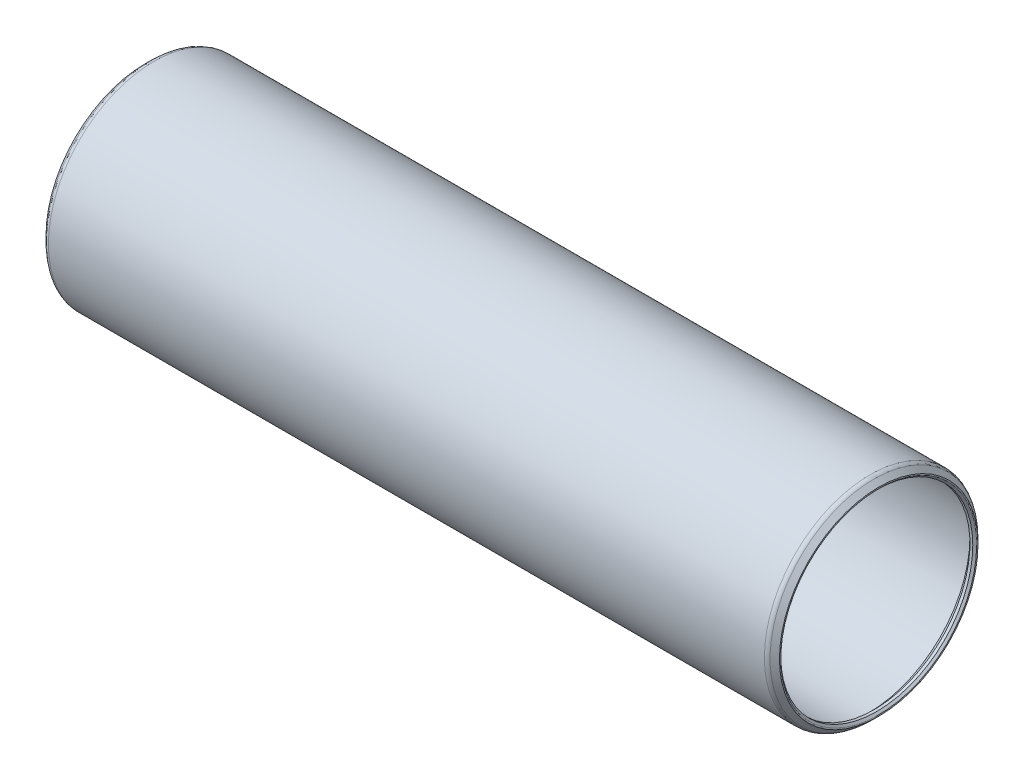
ISO-10303-21;
HEADER;
FILE_DESCRIPTION(('STEP AP214'),'2;1');
FILE_NAME('part.step','',(''),(''),'','','');
FILE_SCHEMA(('AUTOMOTIVE_DESIGN { 1 0 10303 214 1 1 1 1 }'));
ENDSEC;
DATA;
#1=APPLICATION_CONTEXT('core data for automotive mechanical design processes');
#2=APPLICATION_PROTOCOL_DEFINITION('international standard','automotive_design',2000,#1);
#3=PRODUCT_CONTEXT('',#1,'mechanical');
#4=PRODUCT('Part','Part','',(#3));
#5=PRODUCT_RELATED_PRODUCT_CATEGORY('part','',(#4));
#6=PRODUCT_DEFINITION_FORMATION('','',#4);
#7=PRODUCT_DEFINITION_CONTEXT('part definition',#1,'design');
#8=PRODUCT_DEFINITION('design','',#6,#7);
#9=PRODUCT_DEFINITION_SHAPE('','',#8);
#10=(LENGTH_UNIT() NAMED_UNIT(*) SI_UNIT(.MILLI.,.METRE.));
#11=(NAMED_UNIT(*) PLANE_ANGLE_UNIT() SI_UNIT($,.RADIAN.));
#12=(NAMED_UNIT(*) SI_UNIT($,.STERADIAN.) SOLID_ANGLE_UNIT());
#13=UNCERTAINTY_MEASURE_WITH_UNIT(LENGTH_MEASURE(1.E-05),#10,'distance_accuracy_value','');
#14=(GEOMETRIC_REPRESENTATION_CONTEXT(3) GLOBAL_UNCERTAINTY_ASSIGNED_CONTEXT((#13)) GLOBAL_UNIT_ASSIGNED_CONTEXT((#10,
#11,#12)) REPRESENTATION_CONTEXT('',''));
#15=CARTESIAN_POINT('',(0.,0.,0.));
#16=DIRECTION('',(0.,0.,1.));
#17=DIRECTION('',(1.,0.,0.));
#18=AXIS2_PLACEMENT_3D('',#15,#16,#17);
#19=CARTESIAN_POINT('',(96.8629,0.,0.));
#20=DIRECTION('',(-1.,0.,0.));
#21=DIRECTION('',(0.,0.,1.));
#22=AXIS2_PLACEMENT_3D('',#19,#20,#21);
#23=CYLINDRICAL_SURFACE('',#22,13.60805);
#24=CARTESIAN_POINT('',(0.761999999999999,0.,0.));
#25=DIRECTION('',(1.,0.,0.));
#26=DIRECTION('',(0.,0.,-1.));
#27=AXIS2_PLACEMENT_3D('',#24,#25,#26);
#28=CIRCLE('',#27,13.60805);
#29=CARTESIAN_POINT('',(0.761999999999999,0.,-13.60805));
#30=VERTEX_POINT('',#29);
#31=EDGE_CURVE('E117',#30,#30,#28,.F.);
#32=ORIENTED_EDGE('',*,*,#31,.T.);
#33=EDGE_LOOP('',(#32));
#34=FACE_BOUND('',#33,.T.);
#35=CARTESIAN_POINT('',(96.1009,0.,0.));
#36=DIRECTION('',(-1.,0.,0.));
#37=DIRECTION('',(0.,0.,1.));
#38=AXIS2_PLACEMENT_3D('',#35,#36,#37);
#39=CIRCLE('',#38,13.60805);
#40=CARTESIAN_POINT('',(96.1009,0.,13.60805));
#41=VERTEX_POINT('',#40);
#42=EDGE_CURVE('E112',#41,#41,#39,.F.);
#43=ORIENTED_EDGE('',*,*,#42,.T.);
#44=EDGE_LOOP('',(#43));
#45=FACE_BOUND('',#44,.T.);
#46=ADVANCED_FACE('F15',(#34,#45),#23,.F.);
#47=CARTESIAN_POINT('',(0.761999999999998,0.,0.));
#48=DIRECTION('',(1.,0.,0.));
#49=DIRECTION('',(0.,1.,0.));
#50=AXIS2_PLACEMENT_3D('',#47,#48,#49);
#51=CONICAL_SURFACE('',#50,13.60805,0.78539816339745);
#52=CARTESIAN_POINT('',(0.,0.,0.));
#53=DIRECTION('',(-1.,0.,0.));
#54=DIRECTION('',(0.,0.,1.));
#55=AXIS2_PLACEMENT_3D('',#52,#53,#54);
#56=CIRCLE('',#55,12.84605);
#57=CARTESIAN_POINT('',(0.,0.,12.84605));
#58=VERTEX_POINT('',#57);
#59=EDGE_CURVE('E107',#58,#58,#56,.T.);
#60=ORIENTED_EDGE('',*,*,#59,.T.);
#61=EDGE_LOOP('',(#60));
#62=FACE_BOUND('',#61,.T.);
#63=ORIENTED_EDGE('',*,*,#31,.F.);
#64=EDGE_LOOP('',(#63));
#65=FACE_BOUND('',#64,.T.);
#66=ADVANCED_FACE('F124',(#62,#65),#51,.F.);
#67=CARTESIAN_POINT('',(96.1009,0.,0.));
#68=DIRECTION('',(-1.,0.,0.));
#69=DIRECTION('',(0.,-1.,0.));
#70=AXIS2_PLACEMENT_3D('',#67,#68,#69);
#71=CONICAL_SURFACE('',#70,13.60805,0.785398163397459);
#72=ORIENTED_EDGE('',*,*,#42,.F.);
#73=EDGE_LOOP('',(#72));
#74=FACE_BOUND('',#73,.T.);
#75=CARTESIAN_POINT('',(96.8629,0.,0.));
#76=DIRECTION('',(-1.,0.,0.));
#77=DIRECTION('',(0.,0.,1.));
#78=AXIS2_PLACEMENT_3D('',#75,#76,#77);
#79=CIRCLE('',#78,12.84605);
#80=CARTESIAN_POINT('',(96.8629,0.,12.84605));
#81=VERTEX_POINT('',#80);
#82=EDGE_CURVE('E102',#81,#81,#79,.F.);
#83=ORIENTED_EDGE('',*,*,#82,.T.);
#84=EDGE_LOOP('',(#83));
#85=FACE_BOUND('',#84,.T.);
#86=ADVANCED_FACE('F126',(#74,#85),#71,.F.);
#87=CARTESIAN_POINT('',(96.8629,0.,0.));
#88=DIRECTION('',(-1.,0.,0.));
#89=DIRECTION('',(0.,0.,1.));
#90=AXIS2_PLACEMENT_3D('',#87,#88,#89);
#91=CYLINDRICAL_SURFACE('',#90,12.84605);
#92=CARTESIAN_POINT('',(-0.381000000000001,0.,0.));
#93=DIRECTION('',(-1.,0.,0.));
#94=DIRECTION('',(0.,0.,1.));
#95=AXIS2_PLACEMENT_3D('',#92,#93,#94);
#96=CIRCLE('',#95,12.84605);
#97=CARTESIAN_POINT('',(-0.381000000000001,0.,12.84605));
#98=VERTEX_POINT('',#97);
#99=EDGE_CURVE('E97',#98,#98,#96,.T.);
#100=ORIENTED_EDGE('',*,*,#99,.T.);
#101=EDGE_LOOP('',(#100));
#102=FACE_BOUND('',#101,.T.);
#103=ORIENTED_EDGE('',*,*,#59,.F.);
#104=EDGE_LOOP('',(#103));
#105=FACE_BOUND('',#104,.T.);
#106=ADVANCED_FACE('F133',(#102,#105),#91,.F.);
#107=CARTESIAN_POINT('',(96.8629,0.,0.));
#108=DIRECTION('',(-1.,0.,0.));
#109=DIRECTION('',(0.,0.,1.));
#110=AXIS2_PLACEMENT_3D('',#107,#108,#109);
#111=CYLINDRICAL_SURFACE('',#110,12.84605);
#112=ORIENTED_EDGE('',*,*,#82,.F.);
#113=EDGE_LOOP('',(#112));
#114=FACE_BOUND('',#113,.T.);
#115=CARTESIAN_POINT('',(97.2439,0.,0.));
#116=DIRECTION('',(1.,0.,0.));
#117=DIRECTION('',(0.,0.,-1.));
#118=AXIS2_PLACEMENT_3D('',#115,#116,#117);
#119=CIRCLE('',#118,12.84605);
#120=CARTESIAN_POINT('',(97.2439,0.,-12.84605));
#121=VERTEX_POINT('',#120);
#122=EDGE_CURVE('E92',#121,#121,#119,.T.);
#123=ORIENTED_EDGE('',*,*,#122,.T.);
#124=EDGE_LOOP('',(#123));
#125=FACE_BOUND('',#124,.T.);
#126=ADVANCED_FACE('F153',(#114,#125),#111,.F.);
#127=CARTESIAN_POINT('',(-0.639512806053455,0.,0.));
#128=DIRECTION('',(-1.,0.,0.));
#129=DIRECTION('',(0.,0.,1.));
#130=AXIS2_PLACEMENT_3D('',#127,#128,#129);
#131=CONICAL_SURFACE('',#130,13.1045628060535,0.785398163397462);
#132=CARTESIAN_POINT('',(-0.639512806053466,0.,0.));
#133=DIRECTION('',(1.,0.,0.));
#134=DIRECTION('',(0.,0.,-1.));
#135=AXIS2_PLACEMENT_3D('',#132,#133,#134);
#136=CIRCLE('',#135,13.1045628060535);
#137=CARTESIAN_POINT('',(-0.639512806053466,0.,-13.1045628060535));
#138=VERTEX_POINT('',#137);
#139=EDGE_CURVE('E89',#138,#138,#136,.T.);
#140=ORIENTED_EDGE('',*,*,#139,.F.);
#141=EDGE_LOOP('',(#140));
#142=FACE_BOUND('',#141,.T.);
#143=ORIENTED_EDGE('',*,*,#99,.F.);
#144=EDGE_LOOP('',(#143));
#145=FACE_BOUND('',#144,.T.);
#146=ADVANCED_FACE('F150',(#142,#145),#131,.F.);
#147=CARTESIAN_POINT('',(97.5024128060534,0.,0.));
#148=DIRECTION('',(1.,0.,0.));
#149=DIRECTION('',(0.,0.,-1.));
#150=AXIS2_PLACEMENT_3D('',#147,#148,#149);
#151=CONICAL_SURFACE('',#150,13.1045628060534,0.785398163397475);
#152=ORIENTED_EDGE('',*,*,#122,.F.);
#153=EDGE_LOOP('',(#152));
#154=FACE_BOUND('',#153,.T.);
#155=CARTESIAN_POINT('',(97.5024128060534,0.,0.));
#156=DIRECTION('',(1.,0.,0.));
#157=DIRECTION('',(0.,0.,-1.));
#158=AXIS2_PLACEMENT_3D('',#155,#156,#157);
#159=CIRCLE('',#158,13.1045628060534);
#160=CARTESIAN_POINT('',(97.5024128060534,0.,-13.1045628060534));
#161=VERTEX_POINT('',#160);
#162=EDGE_CURVE('E67',#161,#161,#159,.F.);
#163=ORIENTED_EDGE('',*,*,#162,.F.);
#164=EDGE_LOOP('',(#163));
#165=FACE_BOUND('',#164,.T.);
#166=ADVANCED_FACE('F83',(#154,#165),#151,.F.);
#167=CARTESIAN_POINT('',(-0.549710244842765,0.,0.));
#168=DIRECTION('',(1.,0.,0.));
#169=DIRECTION('',(0.,0.,-1.));
#170=AXIS2_PLACEMENT_3D('',#167,#168,#169);
#171=TOROIDAL_SURFACE('',#170,13.1943653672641,0.127000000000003);
#172=CARTESIAN_POINT('',(-0.639512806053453,0.,0.));
#173=DIRECTION('',(1.,0.,0.));
#174=DIRECTION('',(0.,0.,-1.));
#175=AXIS2_PLACEMENT_3D('',#172,#173,#174);
#176=CIRCLE('',#175,13.2841679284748);
#177=CARTESIAN_POINT('',(-0.639512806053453,0.,-13.2841679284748));
#178=VERTEX_POINT('',#177);
#179=EDGE_CURVE('E62',#178,#178,#176,.T.);
#180=ORIENTED_EDGE('',*,*,#179,.F.);
#181=EDGE_LOOP('',(#180));
#182=FACE_BOUND('',#181,.T.);
#183=ORIENTED_EDGE('',*,*,#139,.T.);
#184=EDGE_LOOP('',(#183));
#185=FACE_BOUND('',#184,.T.);
#186=ADVANCED_FACE('F78',(#182,#185),#171,.T.);
#187=CARTESIAN_POINT('',(97.4126102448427,0.,0.));
#188=DIRECTION('',(1.,0.,0.));
#189=DIRECTION('',(0.,0.,-1.));
#190=AXIS2_PLACEMENT_3D('',#187,#188,#189);
#191=TOROIDAL_SURFACE('',#190,13.1943653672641,0.126999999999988);
#192=ORIENTED_EDGE('',*,*,#162,.T.);
#193=EDGE_LOOP('',(#192));
#194=FACE_BOUND('',#193,.T.);
#195=CARTESIAN_POINT('',(97.5024128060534,0.,0.));
#196=DIRECTION('',(-1.,0.,0.));
#197=DIRECTION('',(0.,0.,1.));
#198=AXIS2_PLACEMENT_3D('',#195,#196,#197);
#199=CIRCLE('',#198,13.2841679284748);
#200=CARTESIAN_POINT('',(97.5024128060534,0.,13.2841679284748));
#201=VERTEX_POINT('',#200);
#202=EDGE_CURVE('E57',#201,#201,#199,.T.);
#203=ORIENTED_EDGE('',*,*,#202,.F.);
#204=EDGE_LOOP('',(#203));
#205=FACE_BOUND('',#204,.T.);
#206=ADVANCED_FACE('F74',(#194,#205),#191,.T.);
#207=CARTESIAN_POINT('',(-0.0117653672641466,0.,0.));
#208=DIRECTION('',(1.,0.,0.));
#209=DIRECTION('',(0.,0.,-1.));
#210=AXIS2_PLACEMENT_3D('',#207,#208,#209);
#211=CONICAL_SURFACE('',#210,13.9119153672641,0.785398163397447);
#212=CARTESIAN_POINT('',(-0.0117653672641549,0.,0.));
#213=DIRECTION('',(1.,0.,0.));
#214=DIRECTION('',(0.,0.,-1.));
#215=AXIS2_PLACEMENT_3D('',#212,#213,#214);
#216=CIRCLE('',#215,13.9119153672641);
#217=CARTESIAN_POINT('',(-0.0117653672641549,0.,-13.9119153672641));
#218=VERTEX_POINT('',#217);
#219=EDGE_CURVE('E54',#218,#218,#216,.T.);
#220=ORIENTED_EDGE('',*,*,#219,.F.);
#221=EDGE_LOOP('',(#220));
#222=FACE_BOUND('',#221,.T.);
#223=ORIENTED_EDGE('',*,*,#179,.T.);
#224=EDGE_LOOP('',(#223));
#225=FACE_BOUND('',#224,.T.);
#226=ADVANCED_FACE('F77',(#222,#225),#211,.T.);
#227=CARTESIAN_POINT('',(96.8746653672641,0.,0.));
#228=DIRECTION('',(-1.,0.,0.));
#229=DIRECTION('',(0.,-1.,0.));
#230=AXIS2_PLACEMENT_3D('',#227,#228,#229);
#231=CONICAL_SURFACE('',#230,13.911915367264,0.785398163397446);
#232=ORIENTED_EDGE('',*,*,#202,.T.);
#233=EDGE_LOOP('',(#232));
#234=FACE_BOUND('',#233,.T.);
#235=CARTESIAN_POINT('',(96.8746653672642,0.,0.));
#236=DIRECTION('',(1.,0.,0.));
#237=DIRECTION('',(0.,0.,-1.));
#238=AXIS2_PLACEMENT_3D('',#235,#236,#237);
#239=CIRCLE('',#238,13.9119153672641);
#240=CARTESIAN_POINT('',(96.8746653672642,0.,-13.9119153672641));
#241=VERTEX_POINT('',#240);
#242=EDGE_CURVE('E27',#241,#241,#239,.F.);
#243=ORIENTED_EDGE('',*,*,#242,.F.);
#244=EDGE_LOOP('',(#243));
#245=FACE_BOUND('',#244,.T.);
#246=ADVANCED_FACE('F48',(#234,#245),#231,.T.);
#247=CARTESIAN_POINT('',(0.527049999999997,0.,0.));
#248=DIRECTION('',(1.,0.,0.));
#249=DIRECTION('',(0.,0.,-1.));
#250=AXIS2_PLACEMENT_3D('',#247,#248,#249);
#251=TOROIDAL_SURFACE('',#250,13.3731,0.761999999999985);
#252=CARTESIAN_POINT('',(0.527050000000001,0.,0.));
#253=DIRECTION('',(-1.,0.,0.));
#254=DIRECTION('',(0.,0.,1.));
#255=AXIS2_PLACEMENT_3D('',#252,#253,#254);
#256=CIRCLE('',#255,14.1351);
#257=CARTESIAN_POINT('',(0.527050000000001,0.,14.1351));
#258=VERTEX_POINT('',#257);
#259=EDGE_CURVE('E22',#258,#258,#256,.F.);
#260=ORIENTED_EDGE('',*,*,#259,.F.);
#261=EDGE_LOOP('',(#260));
#262=FACE_BOUND('',#261,.T.);
#263=ORIENTED_EDGE('',*,*,#219,.T.);
#264=EDGE_LOOP('',(#263));
#265=FACE_BOUND('',#264,.T.);
#266=ADVANCED_FACE('F43',(#262,#265),#251,.T.);
#267=CARTESIAN_POINT('',(96.33585,0.,0.));
#268=DIRECTION('',(1.,0.,0.));
#269=DIRECTION('',(0.,0.,-1.));
#270=AXIS2_PLACEMENT_3D('',#267,#268,#269);
#271=TOROIDAL_SURFACE('',#270,13.3731,0.762000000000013);
#272=ORIENTED_EDGE('',*,*,#242,.T.);
#273=EDGE_LOOP('',(#272));
#274=FACE_BOUND('',#273,.T.);
#275=CARTESIAN_POINT('',(96.33585,0.,0.));
#276=DIRECTION('',(-1.,0.,0.));
#277=DIRECTION('',(0.,0.,1.));
#278=AXIS2_PLACEMENT_3D('',#275,#276,#277);
#279=CIRCLE('',#278,14.1351);
#280=CARTESIAN_POINT('',(96.33585,0.,14.1351));
#281=VERTEX_POINT('',#280);
#282=EDGE_CURVE('E10',#281,#281,#279,.T.);
#283=ORIENTED_EDGE('',*,*,#282,.F.);
#284=EDGE_LOOP('',(#283));
#285=FACE_BOUND('',#284,.T.);
#286=ADVANCED_FACE('F38',(#274,#285),#271,.T.);
#287=CARTESIAN_POINT('',(96.8629,0.,0.));
#288=DIRECTION('',(-1.,0.,0.));
#289=DIRECTION('',(0.,0.,1.));
#290=AXIS2_PLACEMENT_3D('',#287,#288,#289);
#291=CYLINDRICAL_SURFACE('',#290,14.1351);
#292=ORIENTED_EDGE('',*,*,#282,.T.);
#293=EDGE_LOOP('',(#292));
#294=FACE_BOUND('',#293,.T.);
#295=ORIENTED_EDGE('',*,*,#259,.T.);
#296=EDGE_LOOP('',(#295));
#297=FACE_BOUND('',#296,.T.);
#298=ADVANCED_FACE('F42',(#294,#297),#291,.T.);
#299=CLOSED_SHELL('',(#46,#66,#86,#106,#126,#146,#166,#186,#206,#226,#246,#266,#286,#298));
#300=MANIFOLD_SOLID_BREP('B1',#299);
#301=ADVANCED_BREP_SHAPE_REPRESENTATION('',(#18,#300),#14);
#302=SHAPE_DEFINITION_REPRESENTATION(#9,#301);
ENDSEC;
END-ISO-10303-21;
